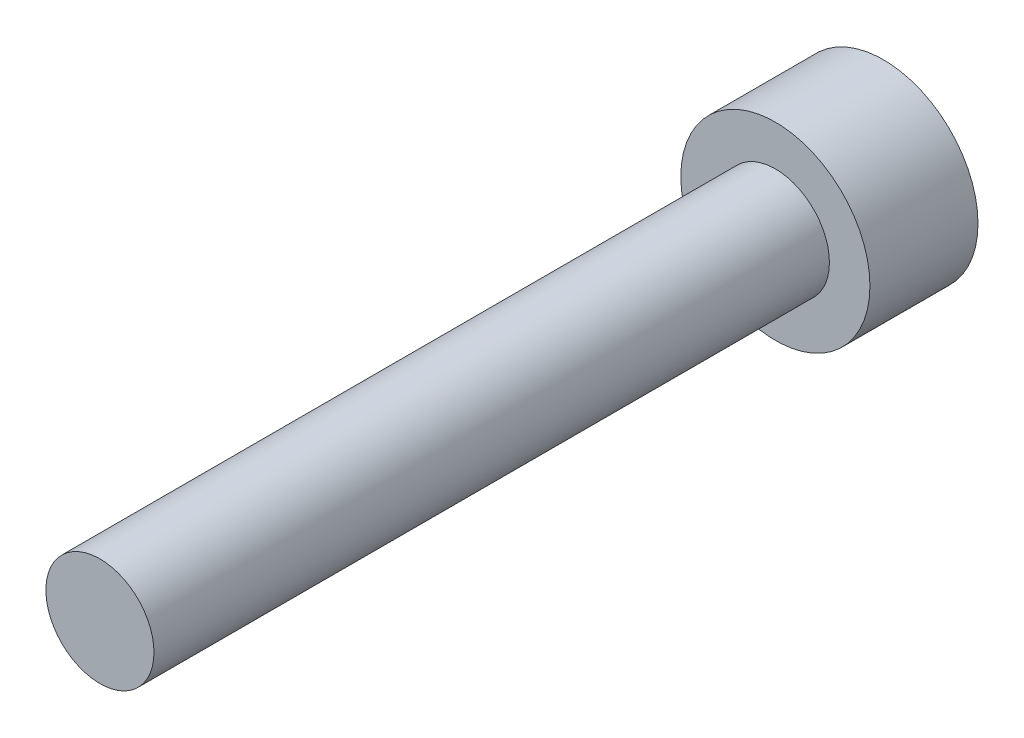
from build123d import *

# Parameters (mm, degrees)
HEX_2_DEPTH = 3


with BuildPart() as part:
    # Sketch6 → Revolve1 (revolve)
    with BuildSketch(Plane(origin=(0, 0, 0), x_dir=(0, 0, -1), z_dir=(1, 0, 0)), mode=Mode.PRIVATE) as revolve1_sk:
        Polygon((-25, 0), (-25, -2), (0, -2), (0, -3.5), (4, -3.5), (4, 0), align=None)
    revolve(revolve1_sk.sketch.rotate(Axis((0, 0, 25), (0, 0, -1)), 270), axis=Axis((0, 0, 25), (0, 0, -1)))

    # Sketch7 → HEX 2 (cut)
    with BuildSketch(Plane(origin=(0, 0, -4), x_dir=(-1, 0, 0), z_dir=(0, 0, -1))):
        Polygon((-1.5, 0.866025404), (-1.5, -0.866025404), (0, -1.732050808), (1.5, -0.866025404), (1.5, 0.866025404), (0, 1.732050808), align=None)
    extrude(amount=-HEX_2_DEPTH, mode=Mode.SUBTRACT)


solid = part.part
